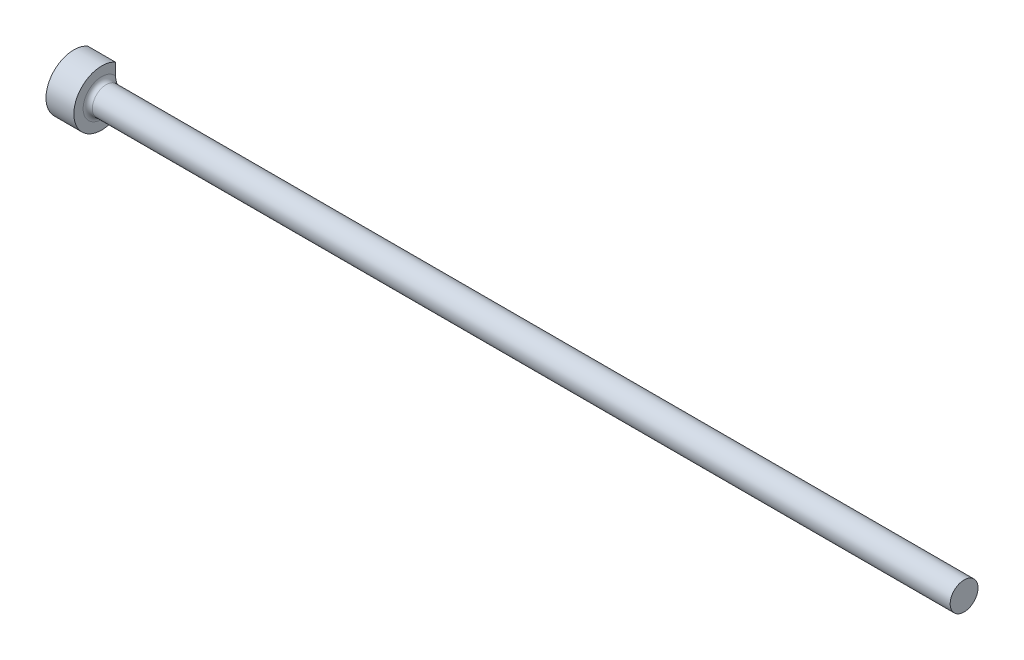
from build123d import *


with BuildPart() as part:
    # Sketch1 → PIN (revolve)
    with BuildSketch(Plane.XY, mode=Mode.PRIVATE) as pin_sk:
        with BuildLine():
            Line((0, 0), (0, 4.7625))
            Line((0, 4.7625), (4.7625, 4.7625))
            Line((4.7625, 4.7625), (4.7625, 3.16865))
            ThreePointArc((4.7625, 3.16865), (4.99312412, 2.61187412), (5.5499, 2.38125))
            Line((5.5499, 2.38125), (152.4, 2.38125))
            Line((152.4, 2.38125), (152.4, 0))
            Line((152.4, 0), (0, 0))
        make_face()
    revolve(pin_sk.sketch.rotate(Axis((152.4, 0, 0), (-1, 0, 0)), 180), axis=Axis((152.4, 0, 0), (-1, 0, 0)))

    # SurfaceCut1
    split(bisect_by=Plane(origin=(0, 0, -2.381504), x_dir=(-1, 0, 0), z_dir=(0, 0, -1)), keep=Keep.BOTTOM)


solid = part.part
